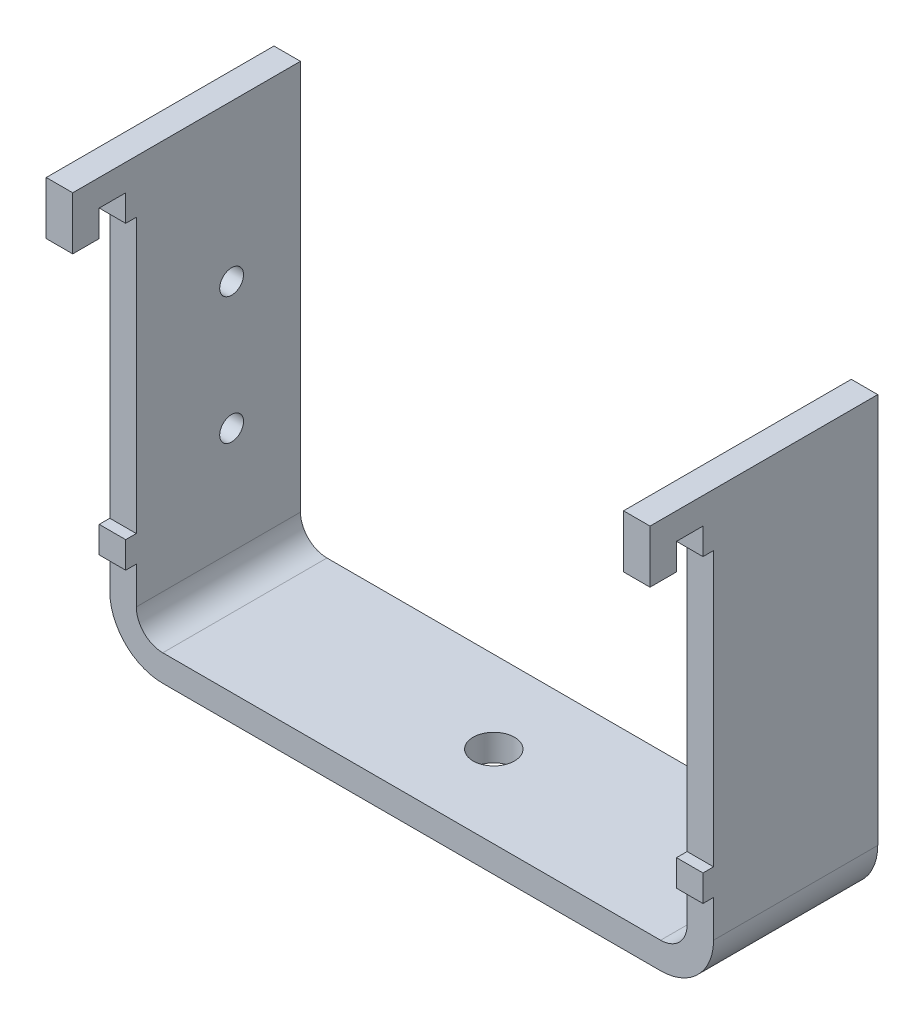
ISO-10303-21;
HEADER;
FILE_DESCRIPTION(('STEP AP214'),'2;1');
FILE_NAME('part.step','',(''),(''),'','','');
FILE_SCHEMA(('AUTOMOTIVE_DESIGN { 1 0 10303 214 1 1 1 1 }'));
ENDSEC;
DATA;
#1=APPLICATION_CONTEXT('core data for automotive mechanical design processes');
#2=APPLICATION_PROTOCOL_DEFINITION('international standard','automotive_design',2000,#1);
#3=PRODUCT_CONTEXT('',#1,'mechanical');
#4=PRODUCT('Part','Part','',(#3));
#5=PRODUCT_RELATED_PRODUCT_CATEGORY('part','',(#4));
#6=PRODUCT_DEFINITION_FORMATION('','',#4);
#7=PRODUCT_DEFINITION_CONTEXT('part definition',#1,'design');
#8=PRODUCT_DEFINITION('design','',#6,#7);
#9=PRODUCT_DEFINITION_SHAPE('','',#8);
#10=(LENGTH_UNIT() NAMED_UNIT(*) SI_UNIT(.MILLI.,.METRE.));
#11=(NAMED_UNIT(*) PLANE_ANGLE_UNIT() SI_UNIT($,.RADIAN.));
#12=(NAMED_UNIT(*) SI_UNIT($,.STERADIAN.) SOLID_ANGLE_UNIT());
#13=UNCERTAINTY_MEASURE_WITH_UNIT(LENGTH_MEASURE(1.E-05),#10,'distance_accuracy_value','');
#14=(GEOMETRIC_REPRESENTATION_CONTEXT(3) GLOBAL_UNCERTAINTY_ASSIGNED_CONTEXT((#13)) GLOBAL_UNIT_ASSIGNED_CONTEXT((#10,
#11,#12)) REPRESENTATION_CONTEXT('',''));
#15=CARTESIAN_POINT('',(0.,0.,0.));
#16=DIRECTION('',(0.,0.,1.));
#17=DIRECTION('',(1.,0.,0.));
#18=AXIS2_PLACEMENT_3D('',#15,#16,#17);
#19=CARTESIAN_POINT('',(0.,5.,0.));
#20=DIRECTION('',(0.,0.,-1.));
#21=DIRECTION('',(-1.,0.,0.));
#22=AXIS2_PLACEMENT_3D('',#19,#20,#21);
#23=PLANE('',#22);
#24=DIRECTION('',(-1.,0.,0.));
#25=VECTOR('',#24,1.);
#26=CARTESIAN_POINT('',(0.,5.,0.));
#27=LINE('',#26,#25);
#28=CARTESIAN_POINT('',(0.,5.,0.));
#29=VERTEX_POINT('',#28);
#30=CARTESIAN_POINT('',(-5.,5.,0.));
#31=VERTEX_POINT('',#30);
#32=EDGE_CURVE('E430',#29,#31,#27,.T.);
#33=ORIENTED_EDGE('',*,*,#32,.F.);
#34=CARTESIAN_POINT('',(5.,5.,0.));
#35=DIRECTION('',(0.,0.,-1.));
#36=DIRECTION('',(-1.,0.,0.));
#37=AXIS2_PLACEMENT_3D('',#34,#35,#36);
#38=CIRCLE('',#37,5.);
#39=CARTESIAN_POINT('',(5.,0.,0.));
#40=VERTEX_POINT('',#39);
#41=EDGE_CURVE('E379',#29,#40,#38,.F.);
#42=ORIENTED_EDGE('',*,*,#41,.T.);
#43=DIRECTION('',(0.,1.,0.));
#44=VECTOR('',#43,1.);
#45=CARTESIAN_POINT('',(5.,-5.,0.));
#46=LINE('',#45,#44);
#47=CARTESIAN_POINT('',(5.,-5.,0.));
#48=VERTEX_POINT('',#47);
#49=EDGE_CURVE('E427',#48,#40,#46,.T.);
#50=ORIENTED_EDGE('',*,*,#49,.F.);
#51=CARTESIAN_POINT('',(5.,5.,0.));
#52=DIRECTION('',(0.,0.,1.));
#53=DIRECTION('',(1.,0.,0.));
#54=AXIS2_PLACEMENT_3D('',#51,#52,#53);
#55=CIRCLE('',#54,10.);
#56=EDGE_CURVE('E391',#31,#48,#55,.T.);
#57=ORIENTED_EDGE('',*,*,#56,.F.);
#58=EDGE_LOOP('',(#33,#42,#50,#57));
#59=FACE_BOUND('',#58,.T.);
#60=ADVANCED_FACE('F34',(#59),#23,.T.);
#61=CARTESIAN_POINT('',(5.,-5.,0.));
#62=DIRECTION('',(0.,0.,-1.));
#63=DIRECTION('',(-1.,0.,0.));
#64=AXIS2_PLACEMENT_3D('',#61,#62,#63);
#65=PLANE('',#64);
#66=DIRECTION('',(0.,-1.,0.));
#67=VECTOR('',#66,1.);
#68=CARTESIAN_POINT('',(0.,0.,0.));
#69=LINE('',#68,#67);
#70=CARTESIAN_POINT('',(0.,78.72,0.));
#71=VERTEX_POINT('',#70);
#72=EDGE_CURVE('E382',#71,#29,#69,.T.);
#73=ORIENTED_EDGE('',*,*,#72,.T.);
#74=ORIENTED_EDGE('',*,*,#32,.T.);
#75=DIRECTION('',(0.,1.,0.));
#76=VECTOR('',#75,1.);
#77=CARTESIAN_POINT('',(-5.,0.,0.));
#78=LINE('',#77,#76);
#79=CARTESIAN_POINT('',(-5.,78.72,0.));
#80=VERTEX_POINT('',#79);
#81=EDGE_CURVE('E388',#80,#31,#78,.F.);
#82=ORIENTED_EDGE('',*,*,#81,.F.);
#83=DIRECTION('',(1.,0.,0.));
#84=VECTOR('',#83,1.);
#85=CARTESIAN_POINT('',(-5.,78.72,0.));
#86=LINE('',#85,#84);
#87=EDGE_CURVE('E385',#80,#71,#86,.T.);
#88=ORIENTED_EDGE('',*,*,#87,.T.);
#89=EDGE_LOOP('',(#73,#74,#82,#88));
#90=FACE_BOUND('',#89,.T.);
#91=ADVANCED_FACE('F499',(#90),#65,.T.);
#92=CARTESIAN_POINT('',(98.9999999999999,-5.,43.));
#93=DIRECTION('',(0.,0.,1.));
#94=DIRECTION('',(1.,0.,0.));
#95=AXIS2_PLACEMENT_3D('',#92,#93,#94);
#96=PLANE('',#95);
#97=DIRECTION('',(-1.,0.,0.));
#98=VECTOR('',#97,1.);
#99=CARTESIAN_POINT('',(423.788893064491,68.72,43.));
#100=LINE('',#99,#98);
#101=CARTESIAN_POINT('',(109.,68.72,43.));
#102=VERTEX_POINT('',#101);
#103=CARTESIAN_POINT('',(104.,68.72,43.));
#104=VERTEX_POINT('',#103);
#105=EDGE_CURVE('E274',#102,#104,#100,.T.);
#106=ORIENTED_EDGE('',*,*,#105,.F.);
#107=DIRECTION('',(0.,1.,0.));
#108=VECTOR('',#107,1.);
#109=CARTESIAN_POINT('',(109.,0.,43.));
#110=LINE('',#109,#108);
#111=CARTESIAN_POINT('',(109.,78.72,43.));
#112=VERTEX_POINT('',#111);
#113=EDGE_CURVE('E111',#102,#112,#110,.T.);
#114=ORIENTED_EDGE('',*,*,#113,.T.);
#115=DIRECTION('',(1.,0.,0.));
#116=VECTOR('',#115,1.);
#117=CARTESIAN_POINT('',(104.,78.72,43.));
#118=LINE('',#117,#116);
#119=CARTESIAN_POINT('',(104.,78.72,43.));
#120=VERTEX_POINT('',#119);
#121=EDGE_CURVE('E352',#120,#112,#118,.T.);
#122=ORIENTED_EDGE('',*,*,#121,.F.);
#123=DIRECTION('',(0.,1.,0.));
#124=VECTOR('',#123,1.);
#125=CARTESIAN_POINT('',(104.,0.,43.));
#126=LINE('',#125,#124);
#127=EDGE_CURVE('E356',#104,#120,#126,.T.);
#128=ORIENTED_EDGE('',*,*,#127,.F.);
#129=EDGE_LOOP('',(#106,#114,#122,#128));
#130=FACE_BOUND('',#129,.T.);
#131=ADVANCED_FACE('F532',(#130),#96,.T.);
#132=CARTESIAN_POINT('',(98.9999999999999,0.,0.));
#133=DIRECTION('',(0.,0.,-1.));
#134=DIRECTION('',(-1.,0.,0.));
#135=AXIS2_PLACEMENT_3D('',#132,#133,#134);
#136=PLANE('',#135);
#137=DIRECTION('',(0.,-1.,0.));
#138=VECTOR('',#137,1.);
#139=CARTESIAN_POINT('',(98.9999999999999,0.,0.));
#140=LINE('',#139,#138);
#141=CARTESIAN_POINT('',(98.9999999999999,0.,0.));
#142=VERTEX_POINT('',#141);
#143=CARTESIAN_POINT('',(98.9999999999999,-5.,0.));
#144=VERTEX_POINT('',#143);
#145=EDGE_CURVE('E424',#142,#144,#140,.T.);
#146=ORIENTED_EDGE('',*,*,#145,.F.);
#147=CARTESIAN_POINT('',(99.,5.,0.));
#148=DIRECTION('',(0.,0.,-1.));
#149=DIRECTION('',(-1.,0.,0.));
#150=AXIS2_PLACEMENT_3D('',#147,#148,#149);
#151=CIRCLE('',#150,5.);
#152=CARTESIAN_POINT('',(104.,5.,0.));
#153=VERTEX_POINT('',#152);
#154=EDGE_CURVE('E373',#142,#153,#151,.F.);
#155=ORIENTED_EDGE('',*,*,#154,.T.);
#156=DIRECTION('',(-1.,0.,0.));
#157=VECTOR('',#156,1.);
#158=CARTESIAN_POINT('',(109.,5.,0.));
#159=LINE('',#158,#157);
#160=CARTESIAN_POINT('',(109.,5.,0.));
#161=VERTEX_POINT('',#160);
#162=EDGE_CURVE('E421',#161,#153,#159,.T.);
#163=ORIENTED_EDGE('',*,*,#162,.F.);
#164=CARTESIAN_POINT('',(99.,5.,0.));
#165=DIRECTION('',(0.,0.,1.));
#166=DIRECTION('',(1.,0.,0.));
#167=AXIS2_PLACEMENT_3D('',#164,#165,#166);
#168=CIRCLE('',#167,10.);
#169=EDGE_CURVE('E353',#144,#161,#168,.T.);
#170=ORIENTED_EDGE('',*,*,#169,.F.);
#171=EDGE_LOOP('',(#146,#155,#163,#170));
#172=FACE_BOUND('',#171,.T.);
#173=ADVANCED_FACE('F519',(#172),#136,.T.);
#174=CARTESIAN_POINT('',(109.,5.,0.));
#175=DIRECTION('',(0.,0.,-1.));
#176=DIRECTION('',(-1.,0.,0.));
#177=AXIS2_PLACEMENT_3D('',#174,#175,#176);
#178=PLANE('',#177);
#179=DIRECTION('',(1.,0.,0.));
#180=VECTOR('',#179,1.);
#181=CARTESIAN_POINT('',(0.,0.,0.));
#182=LINE('',#181,#180);
#183=EDGE_CURVE('E376',#40,#142,#182,.T.);
#184=ORIENTED_EDGE('',*,*,#183,.T.);
#185=ORIENTED_EDGE('',*,*,#145,.T.);
#186=DIRECTION('',(1.,0.,0.));
#187=VECTOR('',#186,1.);
#188=CARTESIAN_POINT('',(0.,-5.,0.));
#189=LINE('',#188,#187);
#190=EDGE_CURVE('E394',#48,#144,#189,.T.);
#191=ORIENTED_EDGE('',*,*,#190,.F.);
#192=ORIENTED_EDGE('',*,*,#49,.T.);
#193=EDGE_LOOP('',(#184,#185,#191,#192));
#194=FACE_BOUND('',#193,.T.);
#195=ADVANCED_FACE('F510',(#194),#178,.T.);
#196=CARTESIAN_POINT('',(109.,0.,43.));
#197=DIRECTION('',(-1.,0.,0.));
#198=DIRECTION('',(0.,0.,1.));
#199=AXIS2_PLACEMENT_3D('',#196,#197,#198);
#200=PLANE('',#199);
#201=ORIENTED_EDGE('',*,*,#113,.F.);
#202=DIRECTION('',(0.,0.,-1.));
#203=VECTOR('',#202,1.);
#204=CARTESIAN_POINT('',(109.,68.72,43.));
#205=LINE('',#204,#203);
#206=CARTESIAN_POINT('',(109.,68.72,38.));
#207=VERTEX_POINT('',#206);
#208=EDGE_CURVE('E271',#102,#207,#205,.T.);
#209=ORIENTED_EDGE('',*,*,#208,.T.);
#210=DIRECTION('',(0.,1.,0.));
#211=VECTOR('',#210,1.);
#212=CARTESIAN_POINT('',(109.,0.,38.));
#213=LINE('',#212,#211);
#214=CARTESIAN_POINT('',(109.,73.72,38.));
#215=VERTEX_POINT('',#214);
#216=EDGE_CURVE('E257',#207,#215,#213,.T.);
#217=ORIENTED_EDGE('',*,*,#216,.T.);
#218=DIRECTION('',(0.,0.,-1.));
#219=VECTOR('',#218,1.);
#220=CARTESIAN_POINT('',(109.,73.72,43.));
#221=LINE('',#220,#219);
#222=CARTESIAN_POINT('',(109.,73.72,33.));
#223=VERTEX_POINT('',#222);
#224=EDGE_CURVE('E346',#215,#223,#221,.T.);
#225=ORIENTED_EDGE('',*,*,#224,.T.);
#226=DIRECTION('',(0.,-1.,0.));
#227=VECTOR('',#226,1.);
#228=CARTESIAN_POINT('',(109.,0.,33.));
#229=LINE('',#228,#227);
#230=CARTESIAN_POINT('',(109.,68.72,33.));
#231=VERTEX_POINT('',#230);
#232=EDGE_CURVE('E339',#223,#231,#229,.T.);
#233=ORIENTED_EDGE('',*,*,#232,.T.);
#234=DIRECTION('',(0.,0.,-1.));
#235=VECTOR('',#234,1.);
#236=CARTESIAN_POINT('',(109.,68.72,43.));
#237=LINE('',#236,#235);
#238=CARTESIAN_POINT('',(109.,68.72,31.));
#239=VERTEX_POINT('',#238);
#240=EDGE_CURVE('E332',#231,#239,#237,.T.);
#241=ORIENTED_EDGE('',*,*,#240,.T.);
#242=DIRECTION('',(0.,-1.,0.));
#243=VECTOR('',#242,1.);
#244=CARTESIAN_POINT('',(109.,0.,31.));
#245=LINE('',#244,#243);
#246=CARTESIAN_POINT('',(109.,17.,31.));
#247=VERTEX_POINT('',#246);
#248=EDGE_CURVE('E325',#239,#247,#245,.T.);
#249=ORIENTED_EDGE('',*,*,#248,.T.);
#250=DIRECTION('',(0.,0.,1.));
#251=VECTOR('',#250,1.);
#252=CARTESIAN_POINT('',(109.,17.,43.));
#253=LINE('',#252,#251);
#254=CARTESIAN_POINT('',(109.,17.,33.));
#255=VERTEX_POINT('',#254);
#256=EDGE_CURVE('E318',#247,#255,#253,.T.);
#257=ORIENTED_EDGE('',*,*,#256,.T.);
#258=DIRECTION('',(0.,-1.,0.));
#259=VECTOR('',#258,1.);
#260=CARTESIAN_POINT('',(109.,0.,33.));
#261=LINE('',#260,#259);
#262=CARTESIAN_POINT('',(109.,12.,33.));
#263=VERTEX_POINT('',#262);
#264=EDGE_CURVE('E311',#255,#263,#261,.T.);
#265=ORIENTED_EDGE('',*,*,#264,.T.);
#266=DIRECTION('',(0.,0.,-1.));
#267=VECTOR('',#266,1.);
#268=CARTESIAN_POINT('',(109.,12.,43.));
#269=LINE('',#268,#267);
#270=CARTESIAN_POINT('',(109.,12.,31.));
#271=VERTEX_POINT('',#270);
#272=EDGE_CURVE('E304',#263,#271,#269,.T.);
#273=ORIENTED_EDGE('',*,*,#272,.T.);
#274=DIRECTION('',(0.,-1.,0.));
#275=VECTOR('',#274,1.);
#276=CARTESIAN_POINT('',(109.,0.,31.));
#277=LINE('',#276,#275);
#278=CARTESIAN_POINT('',(109.,5.,31.));
#279=VERTEX_POINT('',#278);
#280=EDGE_CURVE('E278',#271,#279,#277,.T.);
#281=ORIENTED_EDGE('',*,*,#280,.T.);
#282=DIRECTION('',(0.,0.,-1.));
#283=VECTOR('',#282,1.);
#284=CARTESIAN_POINT('',(109.,5.,43.));
#285=LINE('',#284,#283);
#286=EDGE_CURVE('E103',#279,#161,#285,.T.);
#287=ORIENTED_EDGE('',*,*,#286,.T.);
#288=DIRECTION('',(0.,1.,0.));
#289=VECTOR('',#288,1.);
#290=CARTESIAN_POINT('',(109.,0.,0.));
#291=LINE('',#290,#289);
#292=CARTESIAN_POINT('',(109.,78.72,0.));
#293=VERTEX_POINT('',#292);
#294=EDGE_CURVE('E266',#161,#293,#291,.T.);
#295=ORIENTED_EDGE('',*,*,#294,.T.);
#296=DIRECTION('',(0.,0.,-1.));
#297=VECTOR('',#296,1.);
#298=CARTESIAN_POINT('',(109.,78.72,43.));
#299=LINE('',#298,#297);
#300=EDGE_CURVE('E419',#112,#293,#299,.T.);
#301=ORIENTED_EDGE('',*,*,#300,.F.);
#302=EDGE_LOOP('',(#201,#209,#217,#225,#233,#241,#249,#257,#265,#273,#281,#287,#295,#301));
#303=FACE_BOUND('',#302,.T.);
#304=ADVANCED_FACE('F277',(#303),#200,.F.);
#305=CARTESIAN_POINT('',(104.,78.72,43.));
#306=DIRECTION('',(0.,1.,0.));
#307=DIRECTION('',(0.,0.,1.));
#308=AXIS2_PLACEMENT_3D('',#305,#306,#307);
#309=PLANE('',#308);
#310=DIRECTION('',(1.,0.,0.));
#311=VECTOR('',#310,1.);
#312=CARTESIAN_POINT('',(104.,78.72,0.));
#313=LINE('',#312,#311);
#314=CARTESIAN_POINT('',(104.,78.72,0.));
#315=VERTEX_POINT('',#314);
#316=EDGE_CURVE('E367',#315,#293,#313,.T.);
#317=ORIENTED_EDGE('',*,*,#316,.F.);
#318=DIRECTION('',(0.,0.,-1.));
#319=VECTOR('',#318,1.);
#320=CARTESIAN_POINT('',(104.,78.72,43.));
#321=LINE('',#320,#319);
#322=EDGE_CURVE('E417',#120,#315,#321,.T.);
#323=ORIENTED_EDGE('',*,*,#322,.F.);
#324=ORIENTED_EDGE('',*,*,#121,.T.);
#325=ORIENTED_EDGE('',*,*,#300,.T.);
#326=EDGE_LOOP('',(#317,#323,#324,#325));
#327=FACE_BOUND('',#326,.T.);
#328=ADVANCED_FACE('F530',(#327),#309,.T.);
#329=CARTESIAN_POINT('',(104.,0.,43.));
#330=DIRECTION('',(-1.,0.,0.));
#331=DIRECTION('',(0.,0.,1.));
#332=AXIS2_PLACEMENT_3D('',#329,#330,#331);
#333=PLANE('',#332);
#334=DIRECTION('',(0.,0.,-1.));
#335=VECTOR('',#334,1.);
#336=CARTESIAN_POINT('',(104.,68.72,43.));
#337=LINE('',#336,#335);
#338=CARTESIAN_POINT('',(104.,68.72,38.));
#339=VERTEX_POINT('',#338);
#340=EDGE_CURVE('E273',#104,#339,#337,.T.);
#341=ORIENTED_EDGE('',*,*,#340,.F.);
#342=ORIENTED_EDGE('',*,*,#127,.T.);
#343=ORIENTED_EDGE('',*,*,#322,.T.);
#344=DIRECTION('',(0.,1.,0.));
#345=VECTOR('',#344,1.);
#346=CARTESIAN_POINT('',(104.,0.,0.));
#347=LINE('',#346,#345);
#348=EDGE_CURVE('E370',#153,#315,#347,.T.);
#349=ORIENTED_EDGE('',*,*,#348,.F.);
#350=DIRECTION('',(0.,0.,-1.));
#351=VECTOR('',#350,1.);
#352=CARTESIAN_POINT('',(104.,5.,43.));
#353=LINE('',#352,#351);
#354=CARTESIAN_POINT('',(104.,5.,31.));
#355=VERTEX_POINT('',#354);
#356=EDGE_CURVE('E415',#355,#153,#353,.T.);
#357=ORIENTED_EDGE('',*,*,#356,.F.);
#358=DIRECTION('',(0.,-1.,0.));
#359=VECTOR('',#358,1.);
#360=CARTESIAN_POINT('',(104.,0.,31.));
#361=LINE('',#360,#359);
#362=CARTESIAN_POINT('',(104.,12.,31.));
#363=VERTEX_POINT('',#362);
#364=EDGE_CURVE('E298',#363,#355,#361,.T.);
#365=ORIENTED_EDGE('',*,*,#364,.F.);
#366=DIRECTION('',(0.,0.,-1.));
#367=VECTOR('',#366,1.);
#368=CARTESIAN_POINT('',(104.,12.,43.));
#369=LINE('',#368,#367);
#370=CARTESIAN_POINT('',(104.,12.,33.));
#371=VERTEX_POINT('',#370);
#372=EDGE_CURVE('E302',#371,#363,#369,.T.);
#373=ORIENTED_EDGE('',*,*,#372,.F.);
#374=DIRECTION('',(0.,-1.,0.));
#375=VECTOR('',#374,1.);
#376=CARTESIAN_POINT('',(104.,0.,33.));
#377=LINE('',#376,#375);
#378=CARTESIAN_POINT('',(104.,17.,33.));
#379=VERTEX_POINT('',#378);
#380=EDGE_CURVE('E309',#379,#371,#377,.T.);
#381=ORIENTED_EDGE('',*,*,#380,.F.);
#382=DIRECTION('',(0.,0.,1.));
#383=VECTOR('',#382,1.);
#384=CARTESIAN_POINT('',(104.,17.,43.));
#385=LINE('',#384,#383);
#386=CARTESIAN_POINT('',(104.,17.,31.));
#387=VERTEX_POINT('',#386);
#388=EDGE_CURVE('E316',#387,#379,#385,.T.);
#389=ORIENTED_EDGE('',*,*,#388,.F.);
#390=DIRECTION('',(0.,-1.,0.));
#391=VECTOR('',#390,1.);
#392=CARTESIAN_POINT('',(104.,0.,31.));
#393=LINE('',#392,#391);
#394=CARTESIAN_POINT('',(104.,68.72,31.));
#395=VERTEX_POINT('',#394);
#396=EDGE_CURVE('E323',#395,#387,#393,.T.);
#397=ORIENTED_EDGE('',*,*,#396,.F.);
#398=DIRECTION('',(0.,0.,-1.));
#399=VECTOR('',#398,1.);
#400=CARTESIAN_POINT('',(104.,68.72,43.));
#401=LINE('',#400,#399);
#402=CARTESIAN_POINT('',(104.,68.72,33.));
#403=VERTEX_POINT('',#402);
#404=EDGE_CURVE('E330',#403,#395,#401,.T.);
#405=ORIENTED_EDGE('',*,*,#404,.F.);
#406=DIRECTION('',(0.,-1.,0.));
#407=VECTOR('',#406,1.);
#408=CARTESIAN_POINT('',(104.,0.,33.));
#409=LINE('',#408,#407);
#410=CARTESIAN_POINT('',(104.,73.72,33.));
#411=VERTEX_POINT('',#410);
#412=EDGE_CURVE('E337',#411,#403,#409,.T.);
#413=ORIENTED_EDGE('',*,*,#412,.F.);
#414=DIRECTION('',(0.,0.,-1.));
#415=VECTOR('',#414,1.);
#416=CARTESIAN_POINT('',(104.,73.72,43.));
#417=LINE('',#416,#415);
#418=CARTESIAN_POINT('',(104.,73.72,38.));
#419=VERTEX_POINT('',#418);
#420=EDGE_CURVE('E344',#419,#411,#417,.T.);
#421=ORIENTED_EDGE('',*,*,#420,.F.);
#422=DIRECTION('',(0.,1.,0.));
#423=VECTOR('',#422,1.);
#424=CARTESIAN_POINT('',(104.,0.,38.));
#425=LINE('',#424,#423);
#426=EDGE_CURVE('E267',#339,#419,#425,.T.);
#427=ORIENTED_EDGE('',*,*,#426,.F.);
#428=EDGE_LOOP('',(#341,#342,#343,#349,#357,#365,#373,#381,#389,#397,#405,#413,#421,#427));
#429=FACE_BOUND('',#428,.T.);
#430=ADVANCED_FACE('F534',(#429),#333,.T.);
#431=CARTESIAN_POINT('',(99.,5.,43.));
#432=DIRECTION('',(0.,0.,-1.));
#433=DIRECTION('',(-1.,0.,0.));
#434=AXIS2_PLACEMENT_3D('',#431,#432,#433);
#435=CYLINDRICAL_SURFACE('',#434,5.);
#436=CARTESIAN_POINT('',(99.,5.,31.));
#437=DIRECTION('',(0.,0.,-1.));
#438=DIRECTION('',(0.,1.,0.));
#439=AXIS2_PLACEMENT_3D('',#436,#437,#438);
#440=CIRCLE('',#439,5.);
#441=CARTESIAN_POINT('',(98.9999999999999,0.,31.));
#442=VERTEX_POINT('',#441);
#443=EDGE_CURVE('E296',#355,#442,#440,.T.);
#444=ORIENTED_EDGE('',*,*,#443,.F.);
#445=ORIENTED_EDGE('',*,*,#356,.T.);
#446=ORIENTED_EDGE('',*,*,#154,.F.);
#447=DIRECTION('',(0.,0.,-1.));
#448=VECTOR('',#447,1.);
#449=CARTESIAN_POINT('',(98.9999999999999,0.,43.));
#450=LINE('',#449,#448);
#451=EDGE_CURVE('E413',#442,#142,#450,.T.);
#452=ORIENTED_EDGE('',*,*,#451,.F.);
#453=EDGE_LOOP('',(#444,#445,#446,#452));
#454=FACE_BOUND('',#453,.T.);
#455=ADVANCED_FACE('F644',(#454),#435,.F.);
#456=CARTESIAN_POINT('',(0.,0.,43.));
#457=DIRECTION('',(0.,1.,0.));
#458=DIRECTION('',(0.,0.,1.));
#459=AXIS2_PLACEMENT_3D('',#456,#457,#458);
#460=PLANE('',#459);
#461=CARTESIAN_POINT('',(52.,0.,15.5));
#462=DIRECTION('',(0.,-1.,0.));
#463=DIRECTION('',(0.,0.,-1.));
#464=AXIS2_PLACEMENT_3D('',#461,#462,#463);
#465=CIRCLE('',#464,3.9);
#466=CARTESIAN_POINT('',(52.,0.,11.6));
#467=VERTEX_POINT('',#466);
#468=EDGE_CURVE('E580',#467,#467,#465,.T.);
#469=ORIENTED_EDGE('',*,*,#468,.T.);
#470=EDGE_LOOP('',(#469));
#471=FACE_BOUND('',#470,.T.);
#472=DIRECTION('',(-1.,0.,0.));
#473=VECTOR('',#472,1.);
#474=CARTESIAN_POINT('',(0.,0.,31.));
#475=LINE('',#474,#473);
#476=CARTESIAN_POINT('',(5.,0.,31.));
#477=VERTEX_POINT('',#476);
#478=EDGE_CURVE('E294',#442,#477,#475,.T.);
#479=ORIENTED_EDGE('',*,*,#478,.F.);
#480=ORIENTED_EDGE('',*,*,#451,.T.);
#481=ORIENTED_EDGE('',*,*,#183,.F.);
#482=DIRECTION('',(0.,0.,-1.));
#483=VECTOR('',#482,1.);
#484=CARTESIAN_POINT('',(5.,0.,43.));
#485=LINE('',#484,#483);
#486=EDGE_CURVE('E411',#477,#40,#485,.T.);
#487=ORIENTED_EDGE('',*,*,#486,.F.);
#488=EDGE_LOOP('',(#479,#480,#481,#487));
#489=FACE_BOUND('',#488,.T.);
#490=ADVANCED_FACE('F647',(#471,#489),#460,.T.);
#491=CARTESIAN_POINT('',(5.,5.,43.));
#492=DIRECTION('',(0.,0.,-1.));
#493=DIRECTION('',(-1.,0.,0.));
#494=AXIS2_PLACEMENT_3D('',#491,#492,#493);
#495=CYLINDRICAL_SURFACE('',#494,5.);
#496=CARTESIAN_POINT('',(5.,5.,31.));
#497=DIRECTION('',(0.,0.,-1.));
#498=DIRECTION('',(0.,1.,0.));
#499=AXIS2_PLACEMENT_3D('',#496,#497,#498);
#500=CIRCLE('',#499,5.);
#501=CARTESIAN_POINT('',(0.,5.,31.));
#502=VERTEX_POINT('',#501);
#503=EDGE_CURVE('E292',#477,#502,#500,.T.);
#504=ORIENTED_EDGE('',*,*,#503,.F.);
#505=ORIENTED_EDGE('',*,*,#486,.T.);
#506=ORIENTED_EDGE('',*,*,#41,.F.);
#507=DIRECTION('',(0.,0.,-1.));
#508=VECTOR('',#507,1.);
#509=CARTESIAN_POINT('',(0.,5.,43.));
#510=LINE('',#509,#508);
#511=EDGE_CURVE('E409',#502,#29,#510,.T.);
#512=ORIENTED_EDGE('',*,*,#511,.F.);
#513=EDGE_LOOP('',(#504,#505,#506,#512));
#514=FACE_BOUND('',#513,.T.);
#515=ADVANCED_FACE('F651',(#514),#495,.F.);
#516=CARTESIAN_POINT('',(0.,0.,43.));
#517=DIRECTION('',(1.,0.,0.));
#518=DIRECTION('',(0.,0.,-1.));
#519=AXIS2_PLACEMENT_3D('',#516,#517,#518);
#520=PLANE('',#519);
#521=CARTESIAN_POINT('',(0.,49.22,13.));
#522=DIRECTION('',(-1.,0.,0.));
#523=DIRECTION('',(0.,0.,1.));
#524=AXIS2_PLACEMENT_3D('',#521,#522,#523);
#525=CIRCLE('',#524,2.25);
#526=CARTESIAN_POINT('',(0.,49.22,15.25));
#527=VERTEX_POINT('',#526);
#528=EDGE_CURVE('E591',#527,#527,#525,.T.);
#529=ORIENTED_EDGE('',*,*,#528,.T.);
#530=EDGE_LOOP('',(#529));
#531=FACE_BOUND('',#530,.T.);
#532=CARTESIAN_POINT('',(0.,25.22,13.));
#533=DIRECTION('',(-1.,0.,0.));
#534=DIRECTION('',(0.,0.,1.));
#535=AXIS2_PLACEMENT_3D('',#532,#533,#534);
#536=CIRCLE('',#535,2.25);
#537=CARTESIAN_POINT('',(0.,25.22,15.25));
#538=VERTEX_POINT('',#537);
#539=EDGE_CURVE('E585',#538,#538,#536,.T.);
#540=ORIENTED_EDGE('',*,*,#539,.T.);
#541=EDGE_LOOP('',(#540));
#542=FACE_BOUND('',#541,.T.);
#543=DIRECTION('',(0.,0.,1.));
#544=VECTOR('',#543,1.);
#545=CARTESIAN_POINT('',(0.,68.72,43.));
#546=LINE('',#545,#544);
#547=CARTESIAN_POINT('',(0.,68.72,38.));
#548=VERTEX_POINT('',#547);
#549=CARTESIAN_POINT('',(0.,68.72,43.));
#550=VERTEX_POINT('',#549);
#551=EDGE_CURVE('E48',#548,#550,#546,.T.);
#552=ORIENTED_EDGE('',*,*,#551,.F.);
#553=DIRECTION('',(0.,-1.,0.));
#554=VECTOR('',#553,1.);
#555=CARTESIAN_POINT('',(0.,0.,38.));
#556=LINE('',#555,#554);
#557=CARTESIAN_POINT('',(0.,73.72,38.));
#558=VERTEX_POINT('',#557);
#559=EDGE_CURVE('E348',#558,#548,#556,.T.);
#560=ORIENTED_EDGE('',*,*,#559,.F.);
#561=DIRECTION('',(0.,0.,1.));
#562=VECTOR('',#561,1.);
#563=CARTESIAN_POINT('',(0.,73.72,43.));
#564=LINE('',#563,#562);
#565=CARTESIAN_POINT('',(0.,73.72,33.));
#566=VERTEX_POINT('',#565);
#567=EDGE_CURVE('E342',#566,#558,#564,.T.);
#568=ORIENTED_EDGE('',*,*,#567,.F.);
#569=DIRECTION('',(0.,1.,0.));
#570=VECTOR('',#569,1.);
#571=CARTESIAN_POINT('',(0.,0.,33.));
#572=LINE('',#571,#570);
#573=CARTESIAN_POINT('',(0.,68.72,33.));
#574=VERTEX_POINT('',#573);
#575=EDGE_CURVE('E335',#574,#566,#572,.T.);
#576=ORIENTED_EDGE('',*,*,#575,.F.);
#577=DIRECTION('',(0.,0.,1.));
#578=VECTOR('',#577,1.);
#579=CARTESIAN_POINT('',(0.,68.72,43.));
#580=LINE('',#579,#578);
#581=CARTESIAN_POINT('',(0.,68.72,31.));
#582=VERTEX_POINT('',#581);
#583=EDGE_CURVE('E328',#582,#574,#580,.T.);
#584=ORIENTED_EDGE('',*,*,#583,.F.);
#585=DIRECTION('',(0.,1.,0.));
#586=VECTOR('',#585,1.);
#587=CARTESIAN_POINT('',(0.,0.,31.));
#588=LINE('',#587,#586);
#589=CARTESIAN_POINT('',(0.,17.,31.));
#590=VERTEX_POINT('',#589);
#591=EDGE_CURVE('E321',#590,#582,#588,.T.);
#592=ORIENTED_EDGE('',*,*,#591,.F.);
#593=DIRECTION('',(0.,0.,-1.));
#594=VECTOR('',#593,1.);
#595=CARTESIAN_POINT('',(0.,17.,43.));
#596=LINE('',#595,#594);
#597=CARTESIAN_POINT('',(0.,17.,33.));
#598=VERTEX_POINT('',#597);
#599=EDGE_CURVE('E314',#598,#590,#596,.T.);
#600=ORIENTED_EDGE('',*,*,#599,.F.);
#601=DIRECTION('',(0.,1.,0.));
#602=VECTOR('',#601,1.);
#603=CARTESIAN_POINT('',(0.,0.,33.));
#604=LINE('',#603,#602);
#605=CARTESIAN_POINT('',(0.,12.,33.));
#606=VERTEX_POINT('',#605);
#607=EDGE_CURVE('E307',#606,#598,#604,.T.);
#608=ORIENTED_EDGE('',*,*,#607,.F.);
#609=DIRECTION('',(0.,0.,1.));
#610=VECTOR('',#609,1.);
#611=CARTESIAN_POINT('',(0.,12.,43.));
#612=LINE('',#611,#610);
#613=CARTESIAN_POINT('',(0.,12.,31.));
#614=VERTEX_POINT('',#613);
#615=EDGE_CURVE('E300',#614,#606,#612,.T.);
#616=ORIENTED_EDGE('',*,*,#615,.F.);
#617=DIRECTION('',(0.,1.,0.));
#618=VECTOR('',#617,1.);
#619=CARTESIAN_POINT('',(0.,0.,31.));
#620=LINE('',#619,#618);
#621=EDGE_CURVE('E290',#502,#614,#620,.T.);
#622=ORIENTED_EDGE('',*,*,#621,.F.);
#623=ORIENTED_EDGE('',*,*,#511,.T.);
#624=ORIENTED_EDGE('',*,*,#72,.F.);
#625=DIRECTION('',(0.,0.,-1.));
#626=VECTOR('',#625,1.);
#627=CARTESIAN_POINT('',(0.,78.72,43.));
#628=LINE('',#627,#626);
#629=CARTESIAN_POINT('',(0.,78.72,43.));
#630=VERTEX_POINT('',#629);
#631=EDGE_CURVE('E407',#630,#71,#628,.T.);
#632=ORIENTED_EDGE('',*,*,#631,.F.);
#633=DIRECTION('',(0.,-1.,0.));
#634=VECTOR('',#633,1.);
#635=CARTESIAN_POINT('',(0.,0.,43.));
#636=LINE('',#635,#634);
#637=EDGE_CURVE('E358',#630,#550,#636,.T.);
#638=ORIENTED_EDGE('',*,*,#637,.T.);
#639=EDGE_LOOP('',(#552,#560,#568,#576,#584,#592,#600,#608,#616,#622,#623,#624,#632,#638));
#640=FACE_BOUND('',#639,.T.);
#641=ADVANCED_FACE('F493',(#531,#542,#640),#520,.T.);
#642=CARTESIAN_POINT('',(-5.,78.72,43.));
#643=DIRECTION('',(0.,1.,0.));
#644=DIRECTION('',(0.,0.,1.));
#645=AXIS2_PLACEMENT_3D('',#642,#643,#644);
#646=PLANE('',#645);
#647=ORIENTED_EDGE('',*,*,#87,.F.);
#648=DIRECTION('',(0.,0.,-1.));
#649=VECTOR('',#648,1.);
#650=CARTESIAN_POINT('',(-5.,78.72,43.));
#651=LINE('',#650,#649);
#652=CARTESIAN_POINT('',(-5.,78.72,43.));
#653=VERTEX_POINT('',#652);
#654=EDGE_CURVE('E57',#653,#80,#651,.T.);
#655=ORIENTED_EDGE('',*,*,#654,.F.);
#656=DIRECTION('',(1.,0.,0.));
#657=VECTOR('',#656,1.);
#658=CARTESIAN_POINT('',(-5.,78.72,43.));
#659=LINE('',#658,#657);
#660=EDGE_CURVE('E361',#653,#630,#659,.T.);
#661=ORIENTED_EDGE('',*,*,#660,.T.);
#662=ORIENTED_EDGE('',*,*,#631,.T.);
#663=EDGE_LOOP('',(#647,#655,#661,#662));
#664=FACE_BOUND('',#663,.T.);
#665=ADVANCED_FACE('F490',(#664),#646,.T.);
#666=CARTESIAN_POINT('',(-5.,0.,43.));
#667=DIRECTION('',(1.,0.,0.));
#668=DIRECTION('',(0.,0.,-1.));
#669=AXIS2_PLACEMENT_3D('',#666,#667,#668);
#670=PLANE('',#669);
#671=CARTESIAN_POINT('',(-5.,49.22,13.));
#672=DIRECTION('',(-1.,0.,0.));
#673=DIRECTION('',(0.,0.,1.));
#674=AXIS2_PLACEMENT_3D('',#671,#672,#673);
#675=CIRCLE('',#674,2.25);
#676=CARTESIAN_POINT('',(-5.,49.22,15.25));
#677=VERTEX_POINT('',#676);
#678=EDGE_CURVE('E594',#677,#677,#675,.T.);
#679=ORIENTED_EDGE('',*,*,#678,.F.);
#680=EDGE_LOOP('',(#679));
#681=FACE_BOUND('',#680,.T.);
#682=CARTESIAN_POINT('',(-5.,25.22,13.));
#683=DIRECTION('',(-1.,0.,0.));
#684=DIRECTION('',(0.,0.,1.));
#685=AXIS2_PLACEMENT_3D('',#682,#683,#684);
#686=CIRCLE('',#685,2.25);
#687=CARTESIAN_POINT('',(-5.,25.22,15.25));
#688=VERTEX_POINT('',#687);
#689=EDGE_CURVE('E588',#688,#688,#686,.T.);
#690=ORIENTED_EDGE('',*,*,#689,.F.);
#691=EDGE_LOOP('',(#690));
#692=FACE_BOUND('',#691,.T.);
#693=DIRECTION('',(0.,-1.,0.));
#694=VECTOR('',#693,1.);
#695=CARTESIAN_POINT('',(-5.,0.,38.));
#696=LINE('',#695,#694);
#697=CARTESIAN_POINT('',(-5.,73.72,38.));
#698=VERTEX_POINT('',#697);
#699=CARTESIAN_POINT('',(-5.,68.72,38.));
#700=VERTEX_POINT('',#699);
#701=EDGE_CURVE('E11',#698,#700,#696,.T.);
#702=ORIENTED_EDGE('',*,*,#701,.T.);
#703=DIRECTION('',(0.,0.,1.));
#704=VECTOR('',#703,1.);
#705=CARTESIAN_POINT('',(-5.,68.72,43.));
#706=LINE('',#705,#704);
#707=CARTESIAN_POINT('',(-5.,68.72,43.));
#708=VERTEX_POINT('',#707);
#709=EDGE_CURVE('E485',#700,#708,#706,.T.);
#710=ORIENTED_EDGE('',*,*,#709,.T.);
#711=DIRECTION('',(0.,1.,0.));
#712=VECTOR('',#711,1.);
#713=CARTESIAN_POINT('',(-5.,0.,43.));
#714=LINE('',#713,#712);
#715=EDGE_CURVE('E363',#653,#708,#714,.F.);
#716=ORIENTED_EDGE('',*,*,#715,.F.);
#717=ORIENTED_EDGE('',*,*,#654,.T.);
#718=ORIENTED_EDGE('',*,*,#81,.T.);
#719=DIRECTION('',(0.,0.,-1.));
#720=VECTOR('',#719,1.);
#721=CARTESIAN_POINT('',(-5.,5.,43.));
#722=LINE('',#721,#720);
#723=CARTESIAN_POINT('',(-5.,5.,31.));
#724=VERTEX_POINT('',#723);
#725=EDGE_CURVE('E404',#724,#31,#722,.T.);
#726=ORIENTED_EDGE('',*,*,#725,.F.);
#727=DIRECTION('',(0.,1.,0.));
#728=VECTOR('',#727,1.);
#729=CARTESIAN_POINT('',(-5.,0.,31.));
#730=LINE('',#729,#728);
#731=CARTESIAN_POINT('',(-5.,12.,31.));
#732=VERTEX_POINT('',#731);
#733=EDGE_CURVE('E287',#724,#732,#730,.T.);
#734=ORIENTED_EDGE('',*,*,#733,.T.);
#735=DIRECTION('',(0.,0.,1.));
#736=VECTOR('',#735,1.);
#737=CARTESIAN_POINT('',(-5.,12.,43.));
#738=LINE('',#737,#736);
#739=CARTESIAN_POINT('',(-5.,12.,33.));
#740=VERTEX_POINT('',#739);
#741=EDGE_CURVE('E438',#732,#740,#738,.T.);
#742=ORIENTED_EDGE('',*,*,#741,.T.);
#743=DIRECTION('',(0.,1.,0.));
#744=VECTOR('',#743,1.);
#745=CARTESIAN_POINT('',(-5.,0.,33.));
#746=LINE('',#745,#744);
#747=CARTESIAN_POINT('',(-5.,17.,33.));
#748=VERTEX_POINT('',#747);
#749=EDGE_CURVE('E441',#740,#748,#746,.T.);
#750=ORIENTED_EDGE('',*,*,#749,.T.);
#751=DIRECTION('',(0.,0.,-1.));
#752=VECTOR('',#751,1.);
#753=CARTESIAN_POINT('',(-5.,17.,43.));
#754=LINE('',#753,#752);
#755=CARTESIAN_POINT('',(-5.,17.,31.));
#756=VERTEX_POINT('',#755);
#757=EDGE_CURVE('E444',#748,#756,#754,.T.);
#758=ORIENTED_EDGE('',*,*,#757,.T.);
#759=DIRECTION('',(0.,1.,0.));
#760=VECTOR('',#759,1.);
#761=CARTESIAN_POINT('',(-5.,0.,31.));
#762=LINE('',#761,#760);
#763=CARTESIAN_POINT('',(-5.,68.72,31.));
#764=VERTEX_POINT('',#763);
#765=EDGE_CURVE('E447',#756,#764,#762,.T.);
#766=ORIENTED_EDGE('',*,*,#765,.T.);
#767=DIRECTION('',(0.,0.,1.));
#768=VECTOR('',#767,1.);
#769=CARTESIAN_POINT('',(-5.,68.72,43.));
#770=LINE('',#769,#768);
#771=CARTESIAN_POINT('',(-5.,68.72,33.));
#772=VERTEX_POINT('',#771);
#773=EDGE_CURVE('E450',#764,#772,#770,.T.);
#774=ORIENTED_EDGE('',*,*,#773,.T.);
#775=DIRECTION('',(0.,1.,0.));
#776=VECTOR('',#775,1.);
#777=CARTESIAN_POINT('',(-5.,0.,33.));
#778=LINE('',#777,#776);
#779=CARTESIAN_POINT('',(-5.,73.72,33.));
#780=VERTEX_POINT('',#779);
#781=EDGE_CURVE('E453',#772,#780,#778,.T.);
#782=ORIENTED_EDGE('',*,*,#781,.T.);
#783=DIRECTION('',(0.,0.,1.));
#784=VECTOR('',#783,1.);
#785=CARTESIAN_POINT('',(-5.,73.72,43.));
#786=LINE('',#785,#784);
#787=EDGE_CURVE('E41',#780,#698,#786,.T.);
#788=ORIENTED_EDGE('',*,*,#787,.T.);
#789=EDGE_LOOP('',(#702,#710,#716,#717,#718,#726,#734,#742,#750,#758,#766,#774,#782,#788));
#790=FACE_BOUND('',#789,.T.);
#791=ADVANCED_FACE('F457',(#681,#692,#790),#670,.F.);
#792=CARTESIAN_POINT('',(5.,5.,43.));
#793=DIRECTION('',(0.,0.,-1.));
#794=DIRECTION('',(-1.,0.,0.));
#795=AXIS2_PLACEMENT_3D('',#792,#793,#794);
#796=CYLINDRICAL_SURFACE('',#795,10.);
#797=DIRECTION('',(0.,0.,-1.));
#798=VECTOR('',#797,1.);
#799=CARTESIAN_POINT('',(5.,-5.,43.));
#800=LINE('',#799,#798);
#801=CARTESIAN_POINT('',(5.,-5.,31.));
#802=VERTEX_POINT('',#801);
#803=EDGE_CURVE('E402',#802,#48,#800,.T.);
#804=ORIENTED_EDGE('',*,*,#803,.F.);
#805=CARTESIAN_POINT('',(5.,5.,31.));
#806=DIRECTION('',(0.,0.,-1.));
#807=DIRECTION('',(0.,1.,0.));
#808=AXIS2_PLACEMENT_3D('',#805,#806,#807);
#809=CIRCLE('',#808,10.);
#810=EDGE_CURVE('E280',#802,#724,#809,.T.);
#811=ORIENTED_EDGE('',*,*,#810,.T.);
#812=ORIENTED_EDGE('',*,*,#725,.T.);
#813=ORIENTED_EDGE('',*,*,#56,.T.);
#814=EDGE_LOOP('',(#804,#811,#812,#813));
#815=FACE_BOUND('',#814,.T.);
#816=ADVANCED_FACE('F508',(#815),#796,.T.);
#817=CARTESIAN_POINT('',(0.,-5.,43.));
#818=DIRECTION('',(0.,1.,0.));
#819=DIRECTION('',(0.,0.,1.));
#820=AXIS2_PLACEMENT_3D('',#817,#818,#819);
#821=PLANE('',#820);
#822=CARTESIAN_POINT('',(52.,-5.,15.5));
#823=DIRECTION('',(0.,-1.,0.));
#824=DIRECTION('',(0.,0.,-1.));
#825=AXIS2_PLACEMENT_3D('',#822,#823,#824);
#826=CIRCLE('',#825,3.9);
#827=CARTESIAN_POINT('',(52.,-5.,11.6));
#828=VERTEX_POINT('',#827);
#829=EDGE_CURVE('E582',#828,#828,#826,.T.);
#830=ORIENTED_EDGE('',*,*,#829,.F.);
#831=EDGE_LOOP('',(#830));
#832=FACE_BOUND('',#831,.T.);
#833=DIRECTION('',(0.,0.,-1.));
#834=VECTOR('',#833,1.);
#835=CARTESIAN_POINT('',(98.9999999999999,-5.,43.));
#836=LINE('',#835,#834);
#837=CARTESIAN_POINT('',(99.,-5.,31.));
#838=VERTEX_POINT('',#837);
#839=EDGE_CURVE('E400',#838,#144,#836,.T.);
#840=ORIENTED_EDGE('',*,*,#839,.F.);
#841=DIRECTION('',(-1.,0.,0.));
#842=VECTOR('',#841,1.);
#843=CARTESIAN_POINT('',(423.788893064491,-5.,31.));
#844=LINE('',#843,#842);
#845=EDGE_CURVE('E575',#838,#802,#844,.T.);
#846=ORIENTED_EDGE('',*,*,#845,.T.);
#847=ORIENTED_EDGE('',*,*,#803,.T.);
#848=ORIENTED_EDGE('',*,*,#190,.T.);
#849=EDGE_LOOP('',(#840,#846,#847,#848));
#850=FACE_BOUND('',#849,.T.);
#851=ADVANCED_FACE('F516',(#832,#850),#821,.F.);
#852=CARTESIAN_POINT('',(99.,5.,43.));
#853=DIRECTION('',(0.,0.,-1.));
#854=DIRECTION('',(-1.,0.,0.));
#855=AXIS2_PLACEMENT_3D('',#852,#853,#854);
#856=CYLINDRICAL_SURFACE('',#855,10.);
#857=ORIENTED_EDGE('',*,*,#286,.F.);
#858=CARTESIAN_POINT('',(99.,5.,31.));
#859=DIRECTION('',(0.,0.,-1.));
#860=DIRECTION('',(0.,1.,0.));
#861=AXIS2_PLACEMENT_3D('',#858,#859,#860);
#862=CIRCLE('',#861,10.);
#863=EDGE_CURVE('E435',#279,#838,#862,.T.);
#864=ORIENTED_EDGE('',*,*,#863,.T.);
#865=ORIENTED_EDGE('',*,*,#839,.T.);
#866=ORIENTED_EDGE('',*,*,#169,.T.);
#867=EDGE_LOOP('',(#857,#864,#865,#866));
#868=FACE_BOUND('',#867,.T.);
#869=ADVANCED_FACE('F523',(#868),#856,.T.);
#870=CARTESIAN_POINT('',(99.,5.,43.));
#871=DIRECTION('',(0.,0.,-1.));
#872=DIRECTION('',(-1.,0.,0.));
#873=AXIS2_PLACEMENT_3D('',#870,#871,#872);
#874=PLANE('',#873);
#875=ORIENTED_EDGE('',*,*,#715,.T.);
#876=DIRECTION('',(1.,0.,0.));
#877=VECTOR('',#876,1.);
#878=CARTESIAN_POINT('',(99.,68.72,43.));
#879=LINE('',#878,#877);
#880=EDGE_CURVE('E433',#708,#550,#879,.T.);
#881=ORIENTED_EDGE('',*,*,#880,.T.);
#882=ORIENTED_EDGE('',*,*,#637,.F.);
#883=ORIENTED_EDGE('',*,*,#660,.F.);
#884=EDGE_LOOP('',(#875,#881,#882,#883));
#885=FACE_BOUND('',#884,.T.);
#886=ADVANCED_FACE('F488',(#885),#874,.F.);
#887=CARTESIAN_POINT('',(99.,5.,0.));
#888=DIRECTION('',(0.,0.,-1.));
#889=DIRECTION('',(-1.,0.,0.));
#890=AXIS2_PLACEMENT_3D('',#887,#888,#889);
#891=PLANE('',#890);
#892=ORIENTED_EDGE('',*,*,#294,.F.);
#893=ORIENTED_EDGE('',*,*,#162,.T.);
#894=ORIENTED_EDGE('',*,*,#348,.T.);
#895=ORIENTED_EDGE('',*,*,#316,.T.);
#896=EDGE_LOOP('',(#892,#893,#894,#895));
#897=FACE_BOUND('',#896,.T.);
#898=ADVANCED_FACE('F525',(#897),#891,.T.);
#899=CARTESIAN_POINT('',(423.788893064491,68.72,38.));
#900=DIRECTION('',(0.,0.,1.));
#901=DIRECTION('',(1.,0.,0.));
#902=AXIS2_PLACEMENT_3D('',#899,#900,#901);
#903=PLANE('',#902);
#904=ORIENTED_EDGE('',*,*,#216,.F.);
#905=DIRECTION('',(-1.,0.,0.));
#906=VECTOR('',#905,1.);
#907=CARTESIAN_POINT('',(423.788893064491,68.72,38.));
#908=LINE('',#907,#906);
#909=EDGE_CURVE('E260',#207,#339,#908,.T.);
#910=ORIENTED_EDGE('',*,*,#909,.T.);
#911=ORIENTED_EDGE('',*,*,#426,.T.);
#912=DIRECTION('',(-1.,0.,0.));
#913=VECTOR('',#912,1.);
#914=CARTESIAN_POINT('',(423.788893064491,73.72,38.));
#915=LINE('',#914,#913);
#916=EDGE_CURVE('E263',#215,#419,#915,.T.);
#917=ORIENTED_EDGE('',*,*,#916,.F.);
#918=EDGE_LOOP('',(#904,#910,#911,#917));
#919=FACE_BOUND('',#918,.T.);
#920=ADVANCED_FACE('F259',(#919),#903,.F.);
#921=EDGE_CURVE('E467',#558,#698,#915,.T.);
#922=ORIENTED_EDGE('',*,*,#921,.F.);
#923=ORIENTED_EDGE('',*,*,#559,.T.);
#924=EDGE_CURVE('E275',#548,#700,#908,.T.);
#925=ORIENTED_EDGE('',*,*,#924,.T.);
#926=ORIENTED_EDGE('',*,*,#701,.F.);
#927=EDGE_LOOP('',(#922,#923,#925,#926));
#928=FACE_BOUND('',#927,.T.);
#929=ADVANCED_FACE('F676',(#928),#903,.F.);
#930=CARTESIAN_POINT('',(423.788893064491,73.72,38.));
#931=DIRECTION('',(0.,1.,0.));
#932=DIRECTION('',(0.,0.,1.));
#933=AXIS2_PLACEMENT_3D('',#930,#931,#932);
#934=PLANE('',#933);
#935=ORIENTED_EDGE('',*,*,#224,.F.);
#936=ORIENTED_EDGE('',*,*,#916,.T.);
#937=ORIENTED_EDGE('',*,*,#420,.T.);
#938=DIRECTION('',(-1.,0.,0.));
#939=VECTOR('',#938,1.);
#940=CARTESIAN_POINT('',(423.788893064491,73.72,33.));
#941=LINE('',#940,#939);
#942=EDGE_CURVE('E473',#223,#411,#941,.T.);
#943=ORIENTED_EDGE('',*,*,#942,.F.);
#944=EDGE_LOOP('',(#935,#936,#937,#943));
#945=FACE_BOUND('',#944,.T.);
#946=ADVANCED_FACE('F538',(#945),#934,.F.);
#947=EDGE_CURVE('E464',#566,#780,#941,.T.);
#948=ORIENTED_EDGE('',*,*,#947,.F.);
#949=ORIENTED_EDGE('',*,*,#567,.T.);
#950=ORIENTED_EDGE('',*,*,#921,.T.);
#951=ORIENTED_EDGE('',*,*,#787,.F.);
#952=EDGE_LOOP('',(#948,#949,#950,#951));
#953=FACE_BOUND('',#952,.T.);
#954=ADVANCED_FACE('F463',(#953),#934,.F.);
#955=CARTESIAN_POINT('',(423.788893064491,73.72,33.));
#956=DIRECTION('',(0.,0.,-1.));
#957=DIRECTION('',(-1.,0.,0.));
#958=AXIS2_PLACEMENT_3D('',#955,#956,#957);
#959=PLANE('',#958);
#960=ORIENTED_EDGE('',*,*,#232,.F.);
#961=ORIENTED_EDGE('',*,*,#942,.T.);
#962=ORIENTED_EDGE('',*,*,#412,.T.);
#963=DIRECTION('',(-1.,0.,0.));
#964=VECTOR('',#963,1.);
#965=CARTESIAN_POINT('',(423.788893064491,68.72,33.));
#966=LINE('',#965,#964);
#967=EDGE_CURVE('E474',#231,#403,#966,.T.);
#968=ORIENTED_EDGE('',*,*,#967,.F.);
#969=EDGE_LOOP('',(#960,#961,#962,#968));
#970=FACE_BOUND('',#969,.T.);
#971=ADVANCED_FACE('F542',(#970),#959,.F.);
#972=EDGE_CURVE('E478',#574,#772,#966,.T.);
#973=ORIENTED_EDGE('',*,*,#972,.F.);
#974=ORIENTED_EDGE('',*,*,#575,.T.);
#975=ORIENTED_EDGE('',*,*,#947,.T.);
#976=ORIENTED_EDGE('',*,*,#781,.F.);
#977=EDGE_LOOP('',(#973,#974,#975,#976));
#978=FACE_BOUND('',#977,.T.);
#979=ADVANCED_FACE('F470',(#978),#959,.F.);
#980=CARTESIAN_POINT('',(423.788893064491,68.72,33.));
#981=DIRECTION('',(0.,1.,0.));
#982=DIRECTION('',(0.,0.,1.));
#983=AXIS2_PLACEMENT_3D('',#980,#981,#982);
#984=PLANE('',#983);
#985=ORIENTED_EDGE('',*,*,#240,.F.);
#986=ORIENTED_EDGE('',*,*,#967,.T.);
#987=ORIENTED_EDGE('',*,*,#404,.T.);
#988=DIRECTION('',(-1.,0.,0.));
#989=VECTOR('',#988,1.);
#990=CARTESIAN_POINT('',(423.788893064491,68.72,31.));
#991=LINE('',#990,#989);
#992=EDGE_CURVE('E556',#239,#395,#991,.T.);
#993=ORIENTED_EDGE('',*,*,#992,.F.);
#994=EDGE_LOOP('',(#985,#986,#987,#993));
#995=FACE_BOUND('',#994,.T.);
#996=ADVANCED_FACE('F545',(#995),#984,.F.);
#997=EDGE_CURVE('E561',#582,#764,#991,.T.);
#998=ORIENTED_EDGE('',*,*,#997,.F.);
#999=ORIENTED_EDGE('',*,*,#583,.T.);
#1000=ORIENTED_EDGE('',*,*,#972,.T.);
#1001=ORIENTED_EDGE('',*,*,#773,.F.);
#1002=EDGE_LOOP('',(#998,#999,#1000,#1001));
#1003=FACE_BOUND('',#1002,.T.);
#1004=ADVANCED_FACE('F683',(#1003),#984,.F.);
#1005=CARTESIAN_POINT('',(423.788893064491,68.72,31.));
#1006=DIRECTION('',(0.,0.,-1.));
#1007=DIRECTION('',(0.,1.,0.));
#1008=AXIS2_PLACEMENT_3D('',#1005,#1006,#1007);
#1009=PLANE('',#1008);
#1010=ORIENTED_EDGE('',*,*,#248,.F.);
#1011=ORIENTED_EDGE('',*,*,#992,.T.);
#1012=ORIENTED_EDGE('',*,*,#396,.T.);
#1013=DIRECTION('',(-1.,0.,0.));
#1014=VECTOR('',#1013,1.);
#1015=CARTESIAN_POINT('',(423.788893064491,17.,31.));
#1016=LINE('',#1015,#1014);
#1017=EDGE_CURVE('E555',#247,#387,#1016,.T.);
#1018=ORIENTED_EDGE('',*,*,#1017,.F.);
#1019=EDGE_LOOP('',(#1010,#1011,#1012,#1018));
#1020=FACE_BOUND('',#1019,.T.);
#1021=ADVANCED_FACE('F554',(#1020),#1009,.F.);
#1022=EDGE_CURVE('E562',#590,#756,#1016,.T.);
#1023=ORIENTED_EDGE('',*,*,#1022,.F.);
#1024=ORIENTED_EDGE('',*,*,#591,.T.);
#1025=ORIENTED_EDGE('',*,*,#997,.T.);
#1026=ORIENTED_EDGE('',*,*,#765,.F.);
#1027=EDGE_LOOP('',(#1023,#1024,#1025,#1026));
#1028=FACE_BOUND('',#1027,.T.);
#1029=ADVANCED_FACE('F686',(#1028),#1009,.F.);
#1030=CARTESIAN_POINT('',(423.788893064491,17.,31.));
#1031=DIRECTION('',(0.,-1.,0.));
#1032=DIRECTION('',(0.,0.,-1.));
#1033=AXIS2_PLACEMENT_3D('',#1030,#1031,#1032);
#1034=PLANE('',#1033);
#1035=ORIENTED_EDGE('',*,*,#256,.F.);
#1036=ORIENTED_EDGE('',*,*,#1017,.T.);
#1037=ORIENTED_EDGE('',*,*,#388,.T.);
#1038=DIRECTION('',(-1.,0.,0.));
#1039=VECTOR('',#1038,1.);
#1040=CARTESIAN_POINT('',(423.788893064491,17.,33.));
#1041=LINE('',#1040,#1039);
#1042=EDGE_CURVE('E566',#255,#379,#1041,.T.);
#1043=ORIENTED_EDGE('',*,*,#1042,.F.);
#1044=EDGE_LOOP('',(#1035,#1036,#1037,#1043));
#1045=FACE_BOUND('',#1044,.T.);
#1046=ADVANCED_FACE('F558',(#1045),#1034,.F.);
#1047=EDGE_CURVE('E568',#598,#748,#1041,.T.);
#1048=ORIENTED_EDGE('',*,*,#1047,.F.);
#1049=ORIENTED_EDGE('',*,*,#599,.T.);
#1050=ORIENTED_EDGE('',*,*,#1022,.T.);
#1051=ORIENTED_EDGE('',*,*,#757,.F.);
#1052=EDGE_LOOP('',(#1048,#1049,#1050,#1051));
#1053=FACE_BOUND('',#1052,.T.);
#1054=ADVANCED_FACE('F689',(#1053),#1034,.F.);
#1055=CARTESIAN_POINT('',(423.788893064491,17.,33.));
#1056=DIRECTION('',(0.,0.,-1.));
#1057=DIRECTION('',(-1.,0.,0.));
#1058=AXIS2_PLACEMENT_3D('',#1055,#1056,#1057);
#1059=PLANE('',#1058);
#1060=ORIENTED_EDGE('',*,*,#264,.F.);
#1061=ORIENTED_EDGE('',*,*,#1042,.T.);
#1062=ORIENTED_EDGE('',*,*,#380,.T.);
#1063=DIRECTION('',(-1.,0.,0.));
#1064=VECTOR('',#1063,1.);
#1065=CARTESIAN_POINT('',(423.788893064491,12.,33.));
#1066=LINE('',#1065,#1064);
#1067=EDGE_CURVE('E571',#263,#371,#1066,.T.);
#1068=ORIENTED_EDGE('',*,*,#1067,.F.);
#1069=EDGE_LOOP('',(#1060,#1061,#1062,#1068));
#1070=FACE_BOUND('',#1069,.T.);
#1071=ADVANCED_FACE('F690',(#1070),#1059,.F.);
#1072=EDGE_CURVE('E572',#606,#740,#1066,.T.);
#1073=ORIENTED_EDGE('',*,*,#1072,.F.);
#1074=ORIENTED_EDGE('',*,*,#607,.T.);
#1075=ORIENTED_EDGE('',*,*,#1047,.T.);
#1076=ORIENTED_EDGE('',*,*,#749,.F.);
#1077=EDGE_LOOP('',(#1073,#1074,#1075,#1076));
#1078=FACE_BOUND('',#1077,.T.);
#1079=ADVANCED_FACE('F693',(#1078),#1059,.F.);
#1080=CARTESIAN_POINT('',(423.788893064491,12.,33.));
#1081=DIRECTION('',(0.,1.,0.));
#1082=DIRECTION('',(0.,0.,1.));
#1083=AXIS2_PLACEMENT_3D('',#1080,#1081,#1082);
#1084=PLANE('',#1083);
#1085=ORIENTED_EDGE('',*,*,#272,.F.);
#1086=ORIENTED_EDGE('',*,*,#1067,.T.);
#1087=ORIENTED_EDGE('',*,*,#372,.T.);
#1088=DIRECTION('',(-1.,0.,0.));
#1089=VECTOR('',#1088,1.);
#1090=CARTESIAN_POINT('',(423.788893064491,12.,31.));
#1091=LINE('',#1090,#1089);
#1092=EDGE_CURVE('E579',#271,#363,#1091,.T.);
#1093=ORIENTED_EDGE('',*,*,#1092,.F.);
#1094=EDGE_LOOP('',(#1085,#1086,#1087,#1093));
#1095=FACE_BOUND('',#1094,.T.);
#1096=ADVANCED_FACE('F695',(#1095),#1084,.F.);
#1097=EDGE_CURVE('E576',#614,#732,#1091,.T.);
#1098=ORIENTED_EDGE('',*,*,#1097,.F.);
#1099=ORIENTED_EDGE('',*,*,#615,.T.);
#1100=ORIENTED_EDGE('',*,*,#1072,.T.);
#1101=ORIENTED_EDGE('',*,*,#741,.F.);
#1102=EDGE_LOOP('',(#1098,#1099,#1100,#1101));
#1103=FACE_BOUND('',#1102,.T.);
#1104=ADVANCED_FACE('F698',(#1103),#1084,.F.);
#1105=CARTESIAN_POINT('',(423.788893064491,12.,31.));
#1106=DIRECTION('',(0.,0.,-1.));
#1107=DIRECTION('',(0.,1.,0.));
#1108=AXIS2_PLACEMENT_3D('',#1105,#1106,#1107);
#1109=PLANE('',#1108);
#1110=ORIENTED_EDGE('',*,*,#1092,.T.);
#1111=ORIENTED_EDGE('',*,*,#364,.T.);
#1112=ORIENTED_EDGE('',*,*,#443,.T.);
#1113=ORIENTED_EDGE('',*,*,#478,.T.);
#1114=ORIENTED_EDGE('',*,*,#503,.T.);
#1115=ORIENTED_EDGE('',*,*,#621,.T.);
#1116=ORIENTED_EDGE('',*,*,#1097,.T.);
#1117=ORIENTED_EDGE('',*,*,#733,.F.);
#1118=ORIENTED_EDGE('',*,*,#810,.F.);
#1119=ORIENTED_EDGE('',*,*,#845,.F.);
#1120=ORIENTED_EDGE('',*,*,#863,.F.);
#1121=ORIENTED_EDGE('',*,*,#280,.F.);
#1122=EDGE_LOOP('',(#1110,#1111,#1112,#1113,#1114,#1115,#1116,#1117,#1118,#1119,#1120,#1121));
#1123=FACE_BOUND('',#1122,.T.);
#1124=ADVANCED_FACE('F673',(#1123),#1109,.F.);
#1125=CARTESIAN_POINT('',(423.788893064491,68.72,43.));
#1126=DIRECTION('',(0.,1.,0.));
#1127=DIRECTION('',(0.,0.,1.));
#1128=AXIS2_PLACEMENT_3D('',#1125,#1126,#1127);
#1129=PLANE('',#1128);
#1130=ORIENTED_EDGE('',*,*,#208,.F.);
#1131=ORIENTED_EDGE('',*,*,#105,.T.);
#1132=ORIENTED_EDGE('',*,*,#340,.T.);
#1133=ORIENTED_EDGE('',*,*,#909,.F.);
#1134=EDGE_LOOP('',(#1130,#1131,#1132,#1133));
#1135=FACE_BOUND('',#1134,.T.);
#1136=ADVANCED_FACE('F270',(#1135),#1129,.F.);
#1137=ORIENTED_EDGE('',*,*,#924,.F.);
#1138=ORIENTED_EDGE('',*,*,#551,.T.);
#1139=ORIENTED_EDGE('',*,*,#880,.F.);
#1140=ORIENTED_EDGE('',*,*,#709,.F.);
#1141=EDGE_LOOP('',(#1137,#1138,#1139,#1140));
#1142=FACE_BOUND('',#1141,.T.);
#1143=ADVANCED_FACE('F621',(#1142),#1129,.F.);
#1144=CARTESIAN_POINT('',(52.,0.,15.5));
#1145=DIRECTION('',(0.,-1.,0.));
#1146=DIRECTION('',(0.,0.,-1.));
#1147=AXIS2_PLACEMENT_3D('',#1144,#1145,#1146);
#1148=CYLINDRICAL_SURFACE('',#1147,3.9);
#1149=ORIENTED_EDGE('',*,*,#468,.F.);
#1150=EDGE_LOOP('',(#1149));
#1151=FACE_BOUND('',#1150,.T.);
#1152=ORIENTED_EDGE('',*,*,#829,.T.);
#1153=EDGE_LOOP('',(#1152));
#1154=FACE_BOUND('',#1153,.T.);
#1155=ADVANCED_FACE('F615',(#1151,#1154),#1148,.F.);
#1156=CARTESIAN_POINT('',(0.,25.22,13.));
#1157=DIRECTION('',(-1.,0.,0.));
#1158=DIRECTION('',(0.,0.,1.));
#1159=AXIS2_PLACEMENT_3D('',#1156,#1157,#1158);
#1160=CYLINDRICAL_SURFACE('',#1159,2.25);
#1161=ORIENTED_EDGE('',*,*,#539,.F.);
#1162=EDGE_LOOP('',(#1161));
#1163=FACE_BOUND('',#1162,.T.);
#1164=ORIENTED_EDGE('',*,*,#689,.T.);
#1165=EDGE_LOOP('',(#1164));
#1166=FACE_BOUND('',#1165,.T.);
#1167=ADVANCED_FACE('F605',(#1163,#1166),#1160,.F.);
#1168=CARTESIAN_POINT('',(0.,49.22,13.));
#1169=DIRECTION('',(-1.,0.,0.));
#1170=DIRECTION('',(0.,0.,1.));
#1171=AXIS2_PLACEMENT_3D('',#1168,#1169,#1170);
#1172=CYLINDRICAL_SURFACE('',#1171,2.25);
#1173=ORIENTED_EDGE('',*,*,#528,.F.);
#1174=EDGE_LOOP('',(#1173));
#1175=FACE_BOUND('',#1174,.T.);
#1176=ORIENTED_EDGE('',*,*,#678,.T.);
#1177=EDGE_LOOP('',(#1176));
#1178=FACE_BOUND('',#1177,.T.);
#1179=ADVANCED_FACE('F602',(#1175,#1178),#1172,.F.);
#1180=CLOSED_SHELL('',(#60,#91,#131,#173,#195,#304,#328,#430,#455,#490,#515,#641,#665,#791,#816,
#851,#869,#886,#898,#920,#929,#946,#954,#971,#979,#996,#1004,#1021,#1029,#1046,#1054,#1071,
#1079,#1096,#1104,#1124,#1136,#1143,#1155,#1167,#1179));
#1181=MANIFOLD_SOLID_BREP('B2',#1180);
#1182=ADVANCED_BREP_SHAPE_REPRESENTATION('',(#18,#1181),#14);
#1183=SHAPE_DEFINITION_REPRESENTATION(#9,#1182);
ENDSEC;
END-ISO-10303-21;
